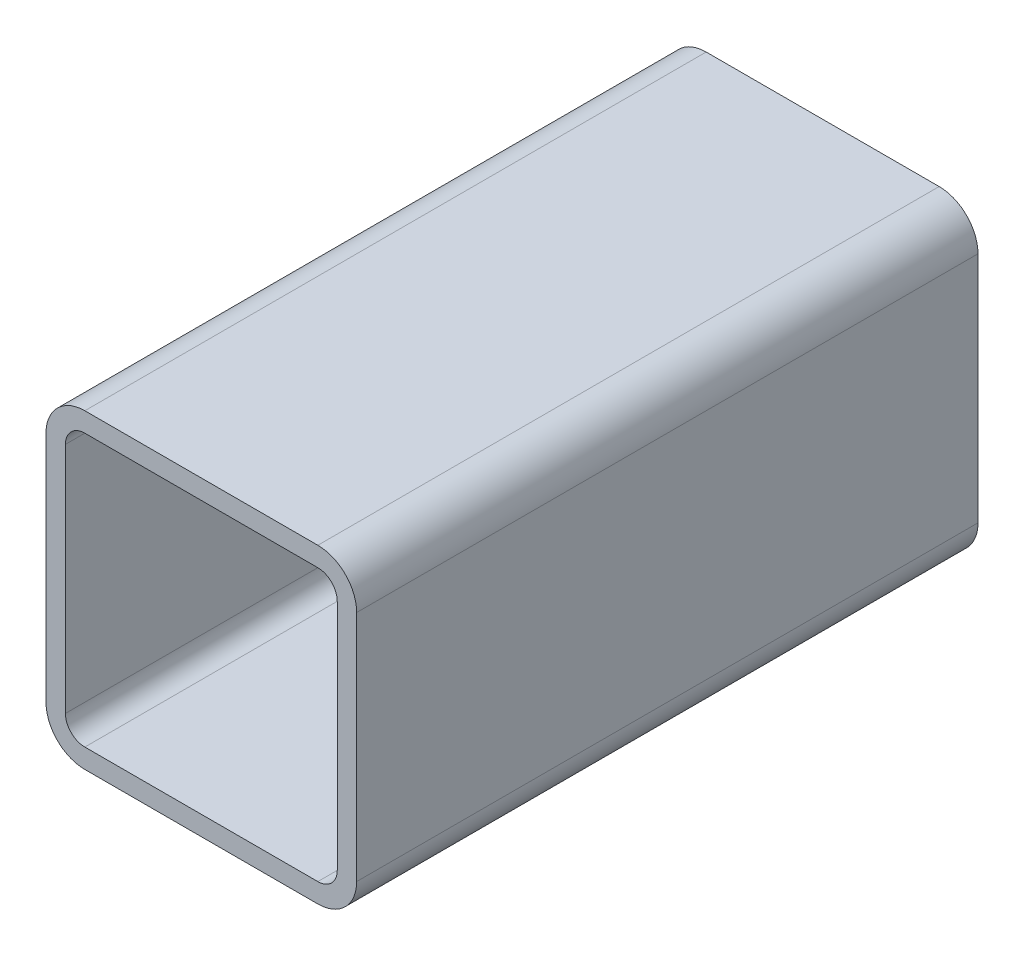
ISO-10303-21;
HEADER;
FILE_DESCRIPTION(('STEP AP214'),'2;1');
FILE_NAME('part.step','',(''),(''),'','','');
FILE_SCHEMA(('AUTOMOTIVE_DESIGN { 1 0 10303 214 1 1 1 1 }'));
ENDSEC;
DATA;
#1=APPLICATION_CONTEXT('core data for automotive mechanical design processes');
#2=APPLICATION_PROTOCOL_DEFINITION('international standard','automotive_design',2000,#1);
#3=PRODUCT_CONTEXT('',#1,'mechanical');
#4=PRODUCT('Part','Part','',(#3));
#5=PRODUCT_RELATED_PRODUCT_CATEGORY('part','',(#4));
#6=PRODUCT_DEFINITION_FORMATION('','',#4);
#7=PRODUCT_DEFINITION_CONTEXT('part definition',#1,'design');
#8=PRODUCT_DEFINITION('design','',#6,#7);
#9=PRODUCT_DEFINITION_SHAPE('','',#8);
#10=(LENGTH_UNIT() NAMED_UNIT(*) SI_UNIT(.MILLI.,.METRE.));
#11=(NAMED_UNIT(*) PLANE_ANGLE_UNIT() SI_UNIT($,.RADIAN.));
#12=(NAMED_UNIT(*) SI_UNIT($,.STERADIAN.) SOLID_ANGLE_UNIT());
#13=UNCERTAINTY_MEASURE_WITH_UNIT(LENGTH_MEASURE(1.E-05),#10,'distance_accuracy_value','');
#14=(GEOMETRIC_REPRESENTATION_CONTEXT(3) GLOBAL_UNCERTAINTY_ASSIGNED_CONTEXT((#13)) GLOBAL_UNIT_ASSIGNED_CONTEXT((#10,
#11,#12)) REPRESENTATION_CONTEXT('',''));
#15=CARTESIAN_POINT('',(0.,0.,0.));
#16=DIRECTION('',(0.,0.,1.));
#17=DIRECTION('',(1.,0.,0.));
#18=AXIS2_PLACEMENT_3D('',#15,#16,#17);
#19=CARTESIAN_POINT('',(19.0973013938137,135.361948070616,304.8));
#20=DIRECTION('',(0.,0.,1.));
#21=DIRECTION('',(1.,0.,0.));
#22=AXIS2_PLACEMENT_3D('',#19,#20,#21);
#23=PLANE('',#22);
#24=CARTESIAN_POINT('',(19.0973013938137,135.361948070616,304.8));
#25=DIRECTION('',(0.,0.,1.));
#26=DIRECTION('',(1.,0.,0.));
#27=AXIS2_PLACEMENT_3D('',#24,#25,#26);
#28=CIRCLE('',#27,19.05);
#29=CARTESIAN_POINT('',(19.0973013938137,154.411948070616,304.8));
#30=VERTEX_POINT('',#29);
#31=CARTESIAN_POINT('',(0.0473013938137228,135.361948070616,304.8));
#32=VERTEX_POINT('',#31);
#33=EDGE_CURVE('E211',#30,#32,#28,.T.);
#34=ORIENTED_EDGE('',*,*,#33,.T.);
#35=DIRECTION('',(0.,-1.,0.));
#36=VECTOR('',#35,1.);
#37=CARTESIAN_POINT('',(0.0473013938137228,135.361948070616,304.8));
#38=LINE('',#37,#36);
#39=CARTESIAN_POINT('',(0.0473013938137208,21.0619480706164,304.8));
#40=VERTEX_POINT('',#39);
#41=EDGE_CURVE('E214',#32,#40,#38,.T.);
#42=ORIENTED_EDGE('',*,*,#41,.T.);
#43=CARTESIAN_POINT('',(19.0973013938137,21.0619480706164,304.8));
#44=DIRECTION('',(0.,0.,1.));
#45=DIRECTION('',(1.,0.,0.));
#46=AXIS2_PLACEMENT_3D('',#43,#44,#45);
#47=CIRCLE('',#46,19.05);
#48=CARTESIAN_POINT('',(19.0973013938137,2.01194807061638,304.8));
#49=VERTEX_POINT('',#48);
#50=EDGE_CURVE('E217',#40,#49,#47,.T.);
#51=ORIENTED_EDGE('',*,*,#50,.T.);
#52=DIRECTION('',(1.,0.,0.));
#53=VECTOR('',#52,1.);
#54=CARTESIAN_POINT('',(19.0973013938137,2.01194807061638,304.8));
#55=LINE('',#54,#53);
#56=CARTESIAN_POINT('',(133.397301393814,2.01194807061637,304.8));
#57=VERTEX_POINT('',#56);
#58=EDGE_CURVE('E219',#49,#57,#55,.T.);
#59=ORIENTED_EDGE('',*,*,#58,.T.);
#60=CARTESIAN_POINT('',(133.397301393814,21.0619480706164,304.8));
#61=DIRECTION('',(0.,0.,1.));
#62=DIRECTION('',(1.,0.,0.));
#63=AXIS2_PLACEMENT_3D('',#60,#61,#62);
#64=CIRCLE('',#63,19.05);
#65=CARTESIAN_POINT('',(152.447301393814,21.0619480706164,304.8));
#66=VERTEX_POINT('',#65);
#67=EDGE_CURVE('E221',#57,#66,#64,.T.);
#68=ORIENTED_EDGE('',*,*,#67,.T.);
#69=DIRECTION('',(0.,1.,0.));
#70=VECTOR('',#69,1.);
#71=CARTESIAN_POINT('',(152.447301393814,21.0619480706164,304.8));
#72=LINE('',#71,#70);
#73=CARTESIAN_POINT('',(152.447301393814,135.361948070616,304.8));
#74=VERTEX_POINT('',#73);
#75=EDGE_CURVE('E223',#66,#74,#72,.T.);
#76=ORIENTED_EDGE('',*,*,#75,.T.);
#77=CARTESIAN_POINT('',(133.397301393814,135.361948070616,304.8));
#78=DIRECTION('',(0.,0.,1.));
#79=DIRECTION('',(1.,0.,0.));
#80=AXIS2_PLACEMENT_3D('',#77,#78,#79);
#81=CIRCLE('',#80,19.05);
#82=CARTESIAN_POINT('',(133.397301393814,154.411948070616,304.8));
#83=VERTEX_POINT('',#82);
#84=EDGE_CURVE('E225',#74,#83,#81,.T.);
#85=ORIENTED_EDGE('',*,*,#84,.T.);
#86=DIRECTION('',(-1.,0.,0.));
#87=VECTOR('',#86,1.);
#88=CARTESIAN_POINT('',(133.397301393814,154.411948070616,304.8));
#89=LINE('',#88,#87);
#90=EDGE_CURVE('E227',#83,#30,#89,.T.);
#91=ORIENTED_EDGE('',*,*,#90,.T.);
#92=EDGE_LOOP('',(#34,#42,#51,#59,#68,#76,#85,#91));
#93=FACE_BOUND('',#92,.T.);
#94=DIRECTION('',(0.,-1.,0.));
#95=VECTOR('',#94,1.);
#96=CARTESIAN_POINT('',(9.57230139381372,21.0619480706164,304.8));
#97=LINE('',#96,#95);
#98=CARTESIAN_POINT('',(9.57230139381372,135.361948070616,304.8));
#99=VERTEX_POINT('',#98);
#100=CARTESIAN_POINT('',(9.57230139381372,21.0619480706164,304.8));
#101=VERTEX_POINT('',#100);
#102=EDGE_CURVE('E154',#99,#101,#97,.T.);
#103=ORIENTED_EDGE('',*,*,#102,.F.);
#104=CARTESIAN_POINT('',(19.0973013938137,135.361948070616,304.8));
#105=DIRECTION('',(0.,0.,1.));
#106=DIRECTION('',(1.,0.,0.));
#107=AXIS2_PLACEMENT_3D('',#104,#105,#106);
#108=CIRCLE('',#107,9.52499999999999);
#109=CARTESIAN_POINT('',(19.0973013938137,144.886948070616,304.8));
#110=VERTEX_POINT('',#109);
#111=EDGE_CURVE('E146',#110,#99,#108,.T.);
#112=ORIENTED_EDGE('',*,*,#111,.F.);
#113=DIRECTION('',(-1.,0.,0.));
#114=VECTOR('',#113,1.);
#115=CARTESIAN_POINT('',(19.0973013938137,144.886948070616,304.8));
#116=LINE('',#115,#114);
#117=CARTESIAN_POINT('',(133.397301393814,144.886948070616,304.8));
#118=VERTEX_POINT('',#117);
#119=EDGE_CURVE('E179',#118,#110,#116,.T.);
#120=ORIENTED_EDGE('',*,*,#119,.F.);
#121=CARTESIAN_POINT('',(133.397301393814,135.361948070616,304.8));
#122=DIRECTION('',(0.,0.,1.));
#123=DIRECTION('',(1.,0.,0.));
#124=AXIS2_PLACEMENT_3D('',#121,#122,#123);
#125=CIRCLE('',#124,9.52499999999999);
#126=CARTESIAN_POINT('',(142.922301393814,135.361948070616,304.8));
#127=VERTEX_POINT('',#126);
#128=EDGE_CURVE('E177',#127,#118,#125,.T.);
#129=ORIENTED_EDGE('',*,*,#128,.F.);
#130=DIRECTION('',(0.,1.,0.));
#131=VECTOR('',#130,1.);
#132=CARTESIAN_POINT('',(142.922301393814,135.361948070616,304.8));
#133=LINE('',#132,#131);
#134=CARTESIAN_POINT('',(142.922301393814,21.0619480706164,304.8));
#135=VERTEX_POINT('',#134);
#136=EDGE_CURVE('E175',#135,#127,#133,.T.);
#137=ORIENTED_EDGE('',*,*,#136,.F.);
#138=CARTESIAN_POINT('',(133.397301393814,21.0619480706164,304.8));
#139=DIRECTION('',(0.,0.,1.));
#140=DIRECTION('',(1.,0.,0.));
#141=AXIS2_PLACEMENT_3D('',#138,#139,#140);
#142=CIRCLE('',#141,9.525);
#143=CARTESIAN_POINT('',(133.397301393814,11.5369480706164,304.8));
#144=VERTEX_POINT('',#143);
#145=EDGE_CURVE('E173',#144,#135,#142,.T.);
#146=ORIENTED_EDGE('',*,*,#145,.F.);
#147=DIRECTION('',(1.,0.,0.));
#148=VECTOR('',#147,1.);
#149=CARTESIAN_POINT('',(133.397301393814,11.5369480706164,304.8));
#150=LINE('',#149,#148);
#151=CARTESIAN_POINT('',(19.0973013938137,11.5369480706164,304.8));
#152=VERTEX_POINT('',#151);
#153=EDGE_CURVE('E169',#152,#144,#150,.T.);
#154=ORIENTED_EDGE('',*,*,#153,.F.);
#155=CARTESIAN_POINT('',(19.0973013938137,21.0619480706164,304.8));
#156=DIRECTION('',(0.,0.,1.));
#157=DIRECTION('',(1.,0.,0.));
#158=AXIS2_PLACEMENT_3D('',#155,#156,#157);
#159=CIRCLE('',#158,9.525);
#160=EDGE_CURVE('E167',#101,#152,#159,.T.);
#161=ORIENTED_EDGE('',*,*,#160,.F.);
#162=EDGE_LOOP('',(#103,#112,#120,#129,#137,#146,#154,#161));
#163=FACE_BOUND('',#162,.T.);
#164=ADVANCED_FACE('F33',(#93,#163),#23,.T.);
#165=CARTESIAN_POINT('',(19.0973013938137,135.361948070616,0.));
#166=DIRECTION('',(0.,0.,1.));
#167=DIRECTION('',(1.,0.,0.));
#168=AXIS2_PLACEMENT_3D('',#165,#166,#167);
#169=PLANE('',#168);
#170=CARTESIAN_POINT('',(19.0973013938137,135.361948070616,0.));
#171=DIRECTION('',(0.,0.,1.));
#172=DIRECTION('',(1.,0.,0.));
#173=AXIS2_PLACEMENT_3D('',#170,#171,#172);
#174=CIRCLE('',#173,19.05);
#175=CARTESIAN_POINT('',(19.0973013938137,154.411948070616,0.));
#176=VERTEX_POINT('',#175);
#177=CARTESIAN_POINT('',(0.0473013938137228,135.361948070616,0.));
#178=VERTEX_POINT('',#177);
#179=EDGE_CURVE('E162',#176,#178,#174,.T.);
#180=ORIENTED_EDGE('',*,*,#179,.F.);
#181=DIRECTION('',(-1.,0.,0.));
#182=VECTOR('',#181,1.);
#183=CARTESIAN_POINT('',(133.397301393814,154.411948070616,0.));
#184=LINE('',#183,#182);
#185=CARTESIAN_POINT('',(133.397301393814,154.411948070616,0.));
#186=VERTEX_POINT('',#185);
#187=EDGE_CURVE('E215',#186,#176,#184,.T.);
#188=ORIENTED_EDGE('',*,*,#187,.F.);
#189=CARTESIAN_POINT('',(133.397301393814,135.361948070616,0.));
#190=DIRECTION('',(0.,0.,1.));
#191=DIRECTION('',(1.,0.,0.));
#192=AXIS2_PLACEMENT_3D('',#189,#190,#191);
#193=CIRCLE('',#192,19.05);
#194=CARTESIAN_POINT('',(152.447301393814,135.361948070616,0.));
#195=VERTEX_POINT('',#194);
#196=EDGE_CURVE('E242',#195,#186,#193,.T.);
#197=ORIENTED_EDGE('',*,*,#196,.F.);
#198=DIRECTION('',(0.,1.,0.));
#199=VECTOR('',#198,1.);
#200=CARTESIAN_POINT('',(152.447301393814,21.0619480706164,0.));
#201=LINE('',#200,#199);
#202=CARTESIAN_POINT('',(152.447301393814,21.0619480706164,0.));
#203=VERTEX_POINT('',#202);
#204=EDGE_CURVE('E240',#203,#195,#201,.T.);
#205=ORIENTED_EDGE('',*,*,#204,.F.);
#206=CARTESIAN_POINT('',(133.397301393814,21.0619480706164,0.));
#207=DIRECTION('',(0.,0.,1.));
#208=DIRECTION('',(1.,0.,0.));
#209=AXIS2_PLACEMENT_3D('',#206,#207,#208);
#210=CIRCLE('',#209,19.05);
#211=CARTESIAN_POINT('',(133.397301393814,2.01194807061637,0.));
#212=VERTEX_POINT('',#211);
#213=EDGE_CURVE('E238',#212,#203,#210,.T.);
#214=ORIENTED_EDGE('',*,*,#213,.F.);
#215=DIRECTION('',(1.,0.,0.));
#216=VECTOR('',#215,1.);
#217=CARTESIAN_POINT('',(19.0973013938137,2.01194807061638,0.));
#218=LINE('',#217,#216);
#219=CARTESIAN_POINT('',(19.0973013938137,2.01194807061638,0.));
#220=VERTEX_POINT('',#219);
#221=EDGE_CURVE('E236',#220,#212,#218,.T.);
#222=ORIENTED_EDGE('',*,*,#221,.F.);
#223=CARTESIAN_POINT('',(19.0973013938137,21.0619480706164,0.));
#224=DIRECTION('',(0.,0.,1.));
#225=DIRECTION('',(1.,0.,0.));
#226=AXIS2_PLACEMENT_3D('',#223,#224,#225);
#227=CIRCLE('',#226,19.05);
#228=CARTESIAN_POINT('',(0.0473013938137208,21.0619480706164,0.));
#229=VERTEX_POINT('',#228);
#230=EDGE_CURVE('E234',#229,#220,#227,.T.);
#231=ORIENTED_EDGE('',*,*,#230,.F.);
#232=DIRECTION('',(0.,-1.,0.));
#233=VECTOR('',#232,1.);
#234=CARTESIAN_POINT('',(0.0473013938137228,135.361948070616,0.));
#235=LINE('',#234,#233);
#236=EDGE_CURVE('E232',#178,#229,#235,.T.);
#237=ORIENTED_EDGE('',*,*,#236,.F.);
#238=EDGE_LOOP('',(#180,#188,#197,#205,#214,#222,#231,#237));
#239=FACE_BOUND('',#238,.T.);
#240=CARTESIAN_POINT('',(19.0973013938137,135.361948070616,0.));
#241=DIRECTION('',(0.,0.,1.));
#242=DIRECTION('',(1.,0.,0.));
#243=AXIS2_PLACEMENT_3D('',#240,#241,#242);
#244=CIRCLE('',#243,9.52499999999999);
#245=CARTESIAN_POINT('',(19.0973013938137,144.886948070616,0.));
#246=VERTEX_POINT('',#245);
#247=CARTESIAN_POINT('',(9.57230139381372,135.361948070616,0.));
#248=VERTEX_POINT('',#247);
#249=EDGE_CURVE('E56',#246,#248,#244,.T.);
#250=ORIENTED_EDGE('',*,*,#249,.T.);
#251=DIRECTION('',(0.,-1.,0.));
#252=VECTOR('',#251,1.);
#253=CARTESIAN_POINT('',(9.57230139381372,21.0619480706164,0.));
#254=LINE('',#253,#252);
#255=CARTESIAN_POINT('',(9.57230139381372,21.0619480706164,0.));
#256=VERTEX_POINT('',#255);
#257=EDGE_CURVE('E161',#248,#256,#254,.T.);
#258=ORIENTED_EDGE('',*,*,#257,.T.);
#259=CARTESIAN_POINT('',(19.0973013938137,21.0619480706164,0.));
#260=DIRECTION('',(0.,0.,1.));
#261=DIRECTION('',(1.,0.,0.));
#262=AXIS2_PLACEMENT_3D('',#259,#260,#261);
#263=CIRCLE('',#262,9.525);
#264=CARTESIAN_POINT('',(19.0973013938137,11.5369480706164,0.));
#265=VERTEX_POINT('',#264);
#266=EDGE_CURVE('E183',#256,#265,#263,.T.);
#267=ORIENTED_EDGE('',*,*,#266,.T.);
#268=DIRECTION('',(1.,0.,0.));
#269=VECTOR('',#268,1.);
#270=CARTESIAN_POINT('',(133.397301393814,11.5369480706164,0.));
#271=LINE('',#270,#269);
#272=CARTESIAN_POINT('',(133.397301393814,11.5369480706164,0.));
#273=VERTEX_POINT('',#272);
#274=EDGE_CURVE('E186',#265,#273,#271,.T.);
#275=ORIENTED_EDGE('',*,*,#274,.T.);
#276=CARTESIAN_POINT('',(133.397301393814,21.0619480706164,0.));
#277=DIRECTION('',(0.,0.,1.));
#278=DIRECTION('',(1.,0.,0.));
#279=AXIS2_PLACEMENT_3D('',#276,#277,#278);
#280=CIRCLE('',#279,9.525);
#281=CARTESIAN_POINT('',(142.922301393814,21.0619480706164,0.));
#282=VERTEX_POINT('',#281);
#283=EDGE_CURVE('E189',#273,#282,#280,.T.);
#284=ORIENTED_EDGE('',*,*,#283,.T.);
#285=DIRECTION('',(0.,1.,0.));
#286=VECTOR('',#285,1.);
#287=CARTESIAN_POINT('',(142.922301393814,135.361948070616,0.));
#288=LINE('',#287,#286);
#289=CARTESIAN_POINT('',(142.922301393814,135.361948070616,0.));
#290=VERTEX_POINT('',#289);
#291=EDGE_CURVE('E192',#282,#290,#288,.T.);
#292=ORIENTED_EDGE('',*,*,#291,.T.);
#293=CARTESIAN_POINT('',(133.397301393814,135.361948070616,0.));
#294=DIRECTION('',(0.,0.,1.));
#295=DIRECTION('',(1.,0.,0.));
#296=AXIS2_PLACEMENT_3D('',#293,#294,#295);
#297=CIRCLE('',#296,9.52499999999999);
#298=CARTESIAN_POINT('',(133.397301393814,144.886948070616,0.));
#299=VERTEX_POINT('',#298);
#300=EDGE_CURVE('E195',#290,#299,#297,.T.);
#301=ORIENTED_EDGE('',*,*,#300,.T.);
#302=DIRECTION('',(-1.,0.,0.));
#303=VECTOR('',#302,1.);
#304=CARTESIAN_POINT('',(19.0973013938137,144.886948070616,0.));
#305=LINE('',#304,#303);
#306=EDGE_CURVE('E155',#299,#246,#305,.T.);
#307=ORIENTED_EDGE('',*,*,#306,.T.);
#308=EDGE_LOOP('',(#250,#258,#267,#275,#284,#292,#301,#307));
#309=FACE_BOUND('',#308,.T.);
#310=ADVANCED_FACE('F272',(#239,#309),#169,.F.);
#311=CARTESIAN_POINT('',(19.0973013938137,135.361948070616,304.8));
#312=DIRECTION('',(0.,0.,-1.));
#313=DIRECTION('',(-1.,0.,0.));
#314=AXIS2_PLACEMENT_3D('',#311,#312,#313);
#315=CYLINDRICAL_SURFACE('',#314,19.05);
#316=ORIENTED_EDGE('',*,*,#179,.T.);
#317=DIRECTION('',(0.,0.,-1.));
#318=VECTOR('',#317,1.);
#319=CARTESIAN_POINT('',(0.0473013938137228,135.361948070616,304.8));
#320=LINE('',#319,#318);
#321=EDGE_CURVE('E11',#32,#178,#320,.T.);
#322=ORIENTED_EDGE('',*,*,#321,.F.);
#323=ORIENTED_EDGE('',*,*,#33,.F.);
#324=DIRECTION('',(0.,0.,-1.));
#325=VECTOR('',#324,1.);
#326=CARTESIAN_POINT('',(19.0973013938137,154.411948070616,304.8));
#327=LINE('',#326,#325);
#328=EDGE_CURVE('E229',#30,#176,#327,.T.);
#329=ORIENTED_EDGE('',*,*,#328,.T.);
#330=EDGE_LOOP('',(#316,#322,#323,#329));
#331=FACE_BOUND('',#330,.T.);
#332=ADVANCED_FACE('F35',(#331),#315,.T.);
#333=CARTESIAN_POINT('',(0.0473013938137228,135.361948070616,304.8));
#334=DIRECTION('',(1.,0.,0.));
#335=DIRECTION('',(0.,0.,-1.));
#336=AXIS2_PLACEMENT_3D('',#333,#334,#335);
#337=PLANE('',#336);
#338=ORIENTED_EDGE('',*,*,#236,.T.);
#339=DIRECTION('',(0.,0.,-1.));
#340=VECTOR('',#339,1.);
#341=CARTESIAN_POINT('',(0.0473013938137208,21.0619480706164,304.8));
#342=LINE('',#341,#340);
#343=EDGE_CURVE('E41',#40,#229,#342,.T.);
#344=ORIENTED_EDGE('',*,*,#343,.F.);
#345=ORIENTED_EDGE('',*,*,#41,.F.);
#346=ORIENTED_EDGE('',*,*,#321,.T.);
#347=EDGE_LOOP('',(#338,#344,#345,#346));
#348=FACE_BOUND('',#347,.T.);
#349=ADVANCED_FACE('F289',(#348),#337,.F.);
#350=CARTESIAN_POINT('',(19.0973013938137,21.0619480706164,304.8));
#351=DIRECTION('',(0.,0.,-1.));
#352=DIRECTION('',(-1.,0.,0.));
#353=AXIS2_PLACEMENT_3D('',#350,#351,#352);
#354=CYLINDRICAL_SURFACE('',#353,19.05);
#355=ORIENTED_EDGE('',*,*,#230,.T.);
#356=DIRECTION('',(0.,0.,-1.));
#357=VECTOR('',#356,1.);
#358=CARTESIAN_POINT('',(19.0973013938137,2.01194807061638,304.8));
#359=LINE('',#358,#357);
#360=EDGE_CURVE('E259',#49,#220,#359,.T.);
#361=ORIENTED_EDGE('',*,*,#360,.F.);
#362=ORIENTED_EDGE('',*,*,#50,.F.);
#363=ORIENTED_EDGE('',*,*,#343,.T.);
#364=EDGE_LOOP('',(#355,#361,#362,#363));
#365=FACE_BOUND('',#364,.T.);
#366=ADVANCED_FACE('F266',(#365),#354,.T.);
#367=CARTESIAN_POINT('',(19.0973013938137,2.01194807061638,304.8));
#368=DIRECTION('',(0.,1.,0.));
#369=DIRECTION('',(0.,0.,1.));
#370=AXIS2_PLACEMENT_3D('',#367,#368,#369);
#371=PLANE('',#370);
#372=ORIENTED_EDGE('',*,*,#221,.T.);
#373=DIRECTION('',(0.,0.,-1.));
#374=VECTOR('',#373,1.);
#375=CARTESIAN_POINT('',(133.397301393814,2.01194807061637,304.8));
#376=LINE('',#375,#374);
#377=EDGE_CURVE('E256',#57,#212,#376,.T.);
#378=ORIENTED_EDGE('',*,*,#377,.F.);
#379=ORIENTED_EDGE('',*,*,#58,.F.);
#380=ORIENTED_EDGE('',*,*,#360,.T.);
#381=EDGE_LOOP('',(#372,#378,#379,#380));
#382=FACE_BOUND('',#381,.T.);
#383=ADVANCED_FACE('F278',(#382),#371,.F.);
#384=CARTESIAN_POINT('',(133.397301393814,21.0619480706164,304.8));
#385=DIRECTION('',(0.,0.,-1.));
#386=DIRECTION('',(-1.,0.,0.));
#387=AXIS2_PLACEMENT_3D('',#384,#385,#386);
#388=CYLINDRICAL_SURFACE('',#387,19.05);
#389=ORIENTED_EDGE('',*,*,#213,.T.);
#390=DIRECTION('',(0.,0.,-1.));
#391=VECTOR('',#390,1.);
#392=CARTESIAN_POINT('',(152.447301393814,21.0619480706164,304.8));
#393=LINE('',#392,#391);
#394=EDGE_CURVE('E253',#66,#203,#393,.T.);
#395=ORIENTED_EDGE('',*,*,#394,.F.);
#396=ORIENTED_EDGE('',*,*,#67,.F.);
#397=ORIENTED_EDGE('',*,*,#377,.T.);
#398=EDGE_LOOP('',(#389,#395,#396,#397));
#399=FACE_BOUND('',#398,.T.);
#400=ADVANCED_FACE('F282',(#399),#388,.T.);
#401=CARTESIAN_POINT('',(152.447301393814,21.0619480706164,304.8));
#402=DIRECTION('',(-1.,0.,0.));
#403=DIRECTION('',(0.,0.,1.));
#404=AXIS2_PLACEMENT_3D('',#401,#402,#403);
#405=PLANE('',#404);
#406=ORIENTED_EDGE('',*,*,#204,.T.);
#407=DIRECTION('',(0.,0.,-1.));
#408=VECTOR('',#407,1.);
#409=CARTESIAN_POINT('',(152.447301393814,135.361948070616,304.8));
#410=LINE('',#409,#408);
#411=EDGE_CURVE('E250',#74,#195,#410,.T.);
#412=ORIENTED_EDGE('',*,*,#411,.F.);
#413=ORIENTED_EDGE('',*,*,#75,.F.);
#414=ORIENTED_EDGE('',*,*,#394,.T.);
#415=EDGE_LOOP('',(#406,#412,#413,#414));
#416=FACE_BOUND('',#415,.T.);
#417=ADVANCED_FACE('F302',(#416),#405,.F.);
#418=CARTESIAN_POINT('',(133.397301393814,135.361948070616,304.8));
#419=DIRECTION('',(0.,0.,-1.));
#420=DIRECTION('',(-1.,0.,0.));
#421=AXIS2_PLACEMENT_3D('',#418,#419,#420);
#422=CYLINDRICAL_SURFACE('',#421,19.05);
#423=ORIENTED_EDGE('',*,*,#196,.T.);
#424=DIRECTION('',(0.,0.,-1.));
#425=VECTOR('',#424,1.);
#426=CARTESIAN_POINT('',(133.397301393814,154.411948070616,304.8));
#427=LINE('',#426,#425);
#428=EDGE_CURVE('E247',#83,#186,#427,.T.);
#429=ORIENTED_EDGE('',*,*,#428,.F.);
#430=ORIENTED_EDGE('',*,*,#84,.F.);
#431=ORIENTED_EDGE('',*,*,#411,.T.);
#432=EDGE_LOOP('',(#423,#429,#430,#431));
#433=FACE_BOUND('',#432,.T.);
#434=ADVANCED_FACE('F300',(#433),#422,.T.);
#435=CARTESIAN_POINT('',(133.397301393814,154.411948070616,304.8));
#436=DIRECTION('',(0.,-1.,0.));
#437=DIRECTION('',(0.,0.,-1.));
#438=AXIS2_PLACEMENT_3D('',#435,#436,#437);
#439=PLANE('',#438);
#440=ORIENTED_EDGE('',*,*,#187,.T.);
#441=ORIENTED_EDGE('',*,*,#328,.F.);
#442=ORIENTED_EDGE('',*,*,#90,.F.);
#443=ORIENTED_EDGE('',*,*,#428,.T.);
#444=EDGE_LOOP('',(#440,#441,#442,#443));
#445=FACE_BOUND('',#444,.T.);
#446=ADVANCED_FACE('F295',(#445),#439,.F.);
#447=CARTESIAN_POINT('',(19.0973013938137,135.361948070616,304.8));
#448=DIRECTION('',(0.,0.,-1.));
#449=DIRECTION('',(-1.,0.,0.));
#450=AXIS2_PLACEMENT_3D('',#447,#448,#449);
#451=CYLINDRICAL_SURFACE('',#450,9.52499999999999);
#452=ORIENTED_EDGE('',*,*,#249,.F.);
#453=DIRECTION('',(0.,0.,-1.));
#454=VECTOR('',#453,1.);
#455=CARTESIAN_POINT('',(19.0973013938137,144.886948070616,304.8));
#456=LINE('',#455,#454);
#457=EDGE_CURVE('E150',#110,#246,#456,.T.);
#458=ORIENTED_EDGE('',*,*,#457,.F.);
#459=ORIENTED_EDGE('',*,*,#111,.T.);
#460=DIRECTION('',(0.,0.,-1.));
#461=VECTOR('',#460,1.);
#462=CARTESIAN_POINT('',(9.57230139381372,135.361948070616,304.8));
#463=LINE('',#462,#461);
#464=EDGE_CURVE('E149',#99,#248,#463,.T.);
#465=ORIENTED_EDGE('',*,*,#464,.T.);
#466=EDGE_LOOP('',(#452,#458,#459,#465));
#467=FACE_BOUND('',#466,.T.);
#468=ADVANCED_FACE('F148',(#467),#451,.F.);
#469=CARTESIAN_POINT('',(9.57230139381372,21.0619480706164,304.8));
#470=DIRECTION('',(1.,0.,0.));
#471=DIRECTION('',(0.,0.,-1.));
#472=AXIS2_PLACEMENT_3D('',#469,#470,#471);
#473=PLANE('',#472);
#474=ORIENTED_EDGE('',*,*,#257,.F.);
#475=ORIENTED_EDGE('',*,*,#464,.F.);
#476=ORIENTED_EDGE('',*,*,#102,.T.);
#477=DIRECTION('',(0.,0.,-1.));
#478=VECTOR('',#477,1.);
#479=CARTESIAN_POINT('',(9.57230139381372,21.0619480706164,304.8));
#480=LINE('',#479,#478);
#481=EDGE_CURVE('E163',#101,#256,#480,.T.);
#482=ORIENTED_EDGE('',*,*,#481,.T.);
#483=EDGE_LOOP('',(#474,#475,#476,#482));
#484=FACE_BOUND('',#483,.T.);
#485=ADVANCED_FACE('F158',(#484),#473,.T.);
#486=CARTESIAN_POINT('',(19.0973013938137,21.0619480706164,304.8));
#487=DIRECTION('',(0.,0.,-1.));
#488=DIRECTION('',(-1.,0.,0.));
#489=AXIS2_PLACEMENT_3D('',#486,#487,#488);
#490=CYLINDRICAL_SURFACE('',#489,9.525);
#491=ORIENTED_EDGE('',*,*,#266,.F.);
#492=ORIENTED_EDGE('',*,*,#481,.F.);
#493=ORIENTED_EDGE('',*,*,#160,.T.);
#494=DIRECTION('',(0.,0.,-1.));
#495=VECTOR('',#494,1.);
#496=CARTESIAN_POINT('',(19.0973013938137,11.5369480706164,304.8));
#497=LINE('',#496,#495);
#498=EDGE_CURVE('E208',#152,#265,#497,.T.);
#499=ORIENTED_EDGE('',*,*,#498,.T.);
#500=EDGE_LOOP('',(#491,#492,#493,#499));
#501=FACE_BOUND('',#500,.T.);
#502=ADVANCED_FACE('F327',(#501),#490,.F.);
#503=CARTESIAN_POINT('',(133.397301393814,11.5369480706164,304.8));
#504=DIRECTION('',(0.,1.,0.));
#505=DIRECTION('',(0.,0.,1.));
#506=AXIS2_PLACEMENT_3D('',#503,#504,#505);
#507=PLANE('',#506);
#508=ORIENTED_EDGE('',*,*,#274,.F.);
#509=ORIENTED_EDGE('',*,*,#498,.F.);
#510=ORIENTED_EDGE('',*,*,#153,.T.);
#511=DIRECTION('',(0.,0.,-1.));
#512=VECTOR('',#511,1.);
#513=CARTESIAN_POINT('',(133.397301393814,11.5369480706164,304.8));
#514=LINE('',#513,#512);
#515=EDGE_CURVE('E206',#144,#273,#514,.T.);
#516=ORIENTED_EDGE('',*,*,#515,.T.);
#517=EDGE_LOOP('',(#508,#509,#510,#516));
#518=FACE_BOUND('',#517,.T.);
#519=ADVANCED_FACE('F331',(#518),#507,.T.);
#520=CARTESIAN_POINT('',(133.397301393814,21.0619480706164,304.8));
#521=DIRECTION('',(0.,0.,-1.));
#522=DIRECTION('',(-1.,0.,0.));
#523=AXIS2_PLACEMENT_3D('',#520,#521,#522);
#524=CYLINDRICAL_SURFACE('',#523,9.525);
#525=ORIENTED_EDGE('',*,*,#283,.F.);
#526=ORIENTED_EDGE('',*,*,#515,.F.);
#527=ORIENTED_EDGE('',*,*,#145,.T.);
#528=DIRECTION('',(0.,0.,-1.));
#529=VECTOR('',#528,1.);
#530=CARTESIAN_POINT('',(142.922301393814,21.0619480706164,304.8));
#531=LINE('',#530,#529);
#532=EDGE_CURVE('E204',#135,#282,#531,.T.);
#533=ORIENTED_EDGE('',*,*,#532,.T.);
#534=EDGE_LOOP('',(#525,#526,#527,#533));
#535=FACE_BOUND('',#534,.T.);
#536=ADVANCED_FACE('F337',(#535),#524,.F.);
#537=CARTESIAN_POINT('',(142.922301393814,135.361948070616,304.8));
#538=DIRECTION('',(-1.,0.,0.));
#539=DIRECTION('',(0.,0.,1.));
#540=AXIS2_PLACEMENT_3D('',#537,#538,#539);
#541=PLANE('',#540);
#542=ORIENTED_EDGE('',*,*,#291,.F.);
#543=ORIENTED_EDGE('',*,*,#532,.F.);
#544=ORIENTED_EDGE('',*,*,#136,.T.);
#545=DIRECTION('',(0.,0.,-1.));
#546=VECTOR('',#545,1.);
#547=CARTESIAN_POINT('',(142.922301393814,135.361948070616,304.8));
#548=LINE('',#547,#546);
#549=EDGE_CURVE('E202',#127,#290,#548,.T.);
#550=ORIENTED_EDGE('',*,*,#549,.T.);
#551=EDGE_LOOP('',(#542,#543,#544,#550));
#552=FACE_BOUND('',#551,.T.);
#553=ADVANCED_FACE('F341',(#552),#541,.T.);
#554=CARTESIAN_POINT('',(133.397301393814,135.361948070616,304.8));
#555=DIRECTION('',(0.,0.,-1.));
#556=DIRECTION('',(-1.,0.,0.));
#557=AXIS2_PLACEMENT_3D('',#554,#555,#556);
#558=CYLINDRICAL_SURFACE('',#557,9.52499999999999);
#559=ORIENTED_EDGE('',*,*,#300,.F.);
#560=ORIENTED_EDGE('',*,*,#549,.F.);
#561=ORIENTED_EDGE('',*,*,#128,.T.);
#562=DIRECTION('',(0.,0.,-1.));
#563=VECTOR('',#562,1.);
#564=CARTESIAN_POINT('',(133.397301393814,144.886948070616,304.8));
#565=LINE('',#564,#563);
#566=EDGE_CURVE('E48',#118,#299,#565,.T.);
#567=ORIENTED_EDGE('',*,*,#566,.T.);
#568=EDGE_LOOP('',(#559,#560,#561,#567));
#569=FACE_BOUND('',#568,.T.);
#570=ADVANCED_FACE('F345',(#569),#558,.F.);
#571=CARTESIAN_POINT('',(19.0973013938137,144.886948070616,304.8));
#572=DIRECTION('',(0.,-1.,0.));
#573=DIRECTION('',(0.,0.,-1.));
#574=AXIS2_PLACEMENT_3D('',#571,#572,#573);
#575=PLANE('',#574);
#576=ORIENTED_EDGE('',*,*,#306,.F.);
#577=ORIENTED_EDGE('',*,*,#566,.F.);
#578=ORIENTED_EDGE('',*,*,#119,.T.);
#579=ORIENTED_EDGE('',*,*,#457,.T.);
#580=EDGE_LOOP('',(#576,#577,#578,#579));
#581=FACE_BOUND('',#580,.T.);
#582=ADVANCED_FACE('F349',(#581),#575,.T.);
#583=CLOSED_SHELL('',(#164,#310,#332,#349,#366,#383,#400,#417,#434,#446,#468,#485,#502,#519,
#536,#553,#570,#582));
#584=MANIFOLD_SOLID_BREP('B2',#583);
#585=ADVANCED_BREP_SHAPE_REPRESENTATION('',(#18,#584),#14);
#586=SHAPE_DEFINITION_REPRESENTATION(#9,#585);
ENDSEC;
END-ISO-10303-21;
